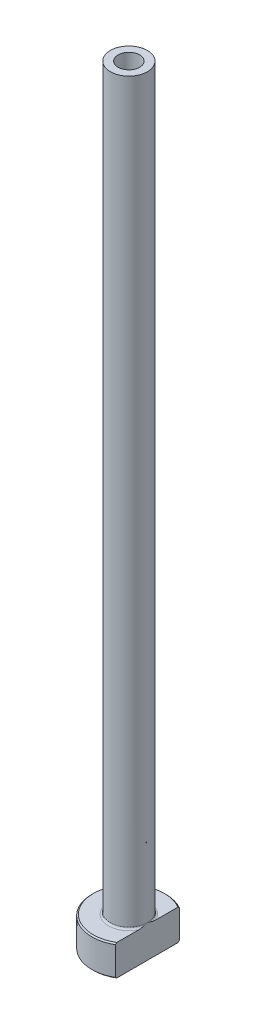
ISO-10303-21;
HEADER;
FILE_DESCRIPTION(('STEP AP214'),'2;1');
FILE_NAME('part.step','',(''),(''),'','','');
FILE_SCHEMA(('AUTOMOTIVE_DESIGN { 1 0 10303 214 1 1 1 1 }'));
ENDSEC;
DATA;
#1=APPLICATION_CONTEXT('core data for automotive mechanical design processes');
#2=APPLICATION_PROTOCOL_DEFINITION('international standard','automotive_design',2000,#1);
#3=PRODUCT_CONTEXT('',#1,'mechanical');
#4=PRODUCT('Part','Part','',(#3));
#5=PRODUCT_RELATED_PRODUCT_CATEGORY('part','',(#4));
#6=PRODUCT_DEFINITION_FORMATION('','',#4);
#7=PRODUCT_DEFINITION_CONTEXT('part definition',#1,'design');
#8=PRODUCT_DEFINITION('design','',#6,#7);
#9=PRODUCT_DEFINITION_SHAPE('','',#8);
#10=(LENGTH_UNIT() NAMED_UNIT(*) SI_UNIT(.MILLI.,.METRE.));
#11=(NAMED_UNIT(*) PLANE_ANGLE_UNIT() SI_UNIT($,.RADIAN.));
#12=(NAMED_UNIT(*) SI_UNIT($,.STERADIAN.) SOLID_ANGLE_UNIT());
#13=UNCERTAINTY_MEASURE_WITH_UNIT(LENGTH_MEASURE(1.E-05),#10,'distance_accuracy_value','');
#14=(GEOMETRIC_REPRESENTATION_CONTEXT(3) GLOBAL_UNCERTAINTY_ASSIGNED_CONTEXT((#13)) GLOBAL_UNIT_ASSIGNED_CONTEXT((#10,
#11,#12)) REPRESENTATION_CONTEXT('',''));
#15=CARTESIAN_POINT('',(0.,0.,0.));
#16=DIRECTION('',(0.,0.,1.));
#17=DIRECTION('',(1.,0.,0.));
#18=AXIS2_PLACEMENT_3D('',#15,#16,#17);
#19=CARTESIAN_POINT('',(0.,92.1876809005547,0.));
#20=DIRECTION('',(0.,1.,0.));
#21=DIRECTION('',(0.,0.,1.));
#22=AXIS2_PLACEMENT_3D('',#19,#20,#21);
#23=CYLINDRICAL_SURFACE('',#22,1.75);
#24=CARTESIAN_POINT('',(0.,125.,0.));
#25=DIRECTION('',(0.,1.,0.));
#26=DIRECTION('',(0.,0.,1.));
#27=AXIS2_PLACEMENT_3D('',#24,#25,#26);
#28=CIRCLE('',#27,1.75);
#29=CARTESIAN_POINT('',(0.,125.,1.75));
#30=VERTEX_POINT('',#29);
#31=EDGE_CURVE('E167',#30,#30,#28,.T.);
#32=ORIENTED_EDGE('',*,*,#31,.T.);
#33=EDGE_LOOP('',(#32));
#34=FACE_BOUND('',#33,.T.);
#35=CARTESIAN_POINT('',(0.,80.,0.));
#36=DIRECTION('',(0.,1.,0.));
#37=DIRECTION('',(0.,0.,1.));
#38=AXIS2_PLACEMENT_3D('',#35,#36,#37);
#39=CIRCLE('',#38,1.75);
#40=CARTESIAN_POINT('',(0.,80.,1.75));
#41=VERTEX_POINT('',#40);
#42=EDGE_CURVE('E170',#41,#41,#39,.T.);
#43=ORIENTED_EDGE('',*,*,#42,.F.);
#44=EDGE_LOOP('',(#43));
#45=FACE_BOUND('',#44,.T.);
#46=ADVANCED_FACE('F32',(#34,#45),#23,.F.);
#47=CARTESIAN_POINT('',(-1.75,125.,0.));
#48=DIRECTION('',(0.,1.,0.));
#49=DIRECTION('',(0.,0.,1.));
#50=AXIS2_PLACEMENT_3D('',#47,#48,#49);
#51=PLANE('',#50);
#52=CARTESIAN_POINT('',(0.,125.,0.));
#53=DIRECTION('',(0.,1.,0.));
#54=DIRECTION('',(0.,0.,1.));
#55=AXIS2_PLACEMENT_3D('',#52,#53,#54);
#56=CIRCLE('',#55,3.);
#57=CARTESIAN_POINT('',(0.,125.,3.));
#58=VERTEX_POINT('',#57);
#59=EDGE_CURVE('E174',#58,#58,#56,.T.);
#60=ORIENTED_EDGE('',*,*,#59,.T.);
#61=EDGE_LOOP('',(#60));
#62=FACE_BOUND('',#61,.T.);
#63=ORIENTED_EDGE('',*,*,#31,.F.);
#64=EDGE_LOOP('',(#63));
#65=FACE_BOUND('',#64,.T.);
#66=ADVANCED_FACE('F157',(#62,#65),#51,.T.);
#67=CARTESIAN_POINT('',(0.,92.1876809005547,0.));
#68=DIRECTION('',(0.,1.,0.));
#69=DIRECTION('',(0.,0.,1.));
#70=AXIS2_PLACEMENT_3D('',#67,#68,#69);
#71=CYLINDRICAL_SURFACE('',#70,3.);
#72=CARTESIAN_POINT('',(0.,5.3,0.));
#73=DIRECTION('',(0.,1.,0.));
#74=DIRECTION('',(0.,0.,1.));
#75=AXIS2_PLACEMENT_3D('',#72,#73,#74);
#76=CIRCLE('',#75,3.);
#77=CARTESIAN_POINT('',(3.,5.3,0.));
#78=VERTEX_POINT('',#77);
#79=EDGE_CURVE('E180',#78,#78,#76,.T.);
#80=ORIENTED_EDGE('',*,*,#79,.T.);
#81=EDGE_LOOP('',(#80));
#82=FACE_BOUND('',#81,.T.);
#83=ORIENTED_EDGE('',*,*,#59,.F.);
#84=EDGE_LOOP('',(#83));
#85=FACE_BOUND('',#84,.T.);
#86=ADVANCED_FACE('F162',(#82,#85),#71,.T.);
#87=CARTESIAN_POINT('',(-2.99999999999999,5.,0.));
#88=DIRECTION('',(0.,1.,0.));
#89=DIRECTION('',(0.,0.,1.));
#90=AXIS2_PLACEMENT_3D('',#87,#88,#89);
#91=PLANE('',#90);
#92=DIRECTION('',(0.,0.,1.));
#93=VECTOR('',#92,1.);
#94=CARTESIAN_POINT('',(3.,5.,0.));
#95=LINE('',#94,#93);
#96=CARTESIAN_POINT('',(3.,5.,-4.96386945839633));
#97=VERTEX_POINT('',#96);
#98=CARTESIAN_POINT('',(3.,5.,-1.37477270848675));
#99=VERTEX_POINT('',#98);
#100=EDGE_CURVE('E54',#97,#99,#95,.T.);
#101=ORIENTED_EDGE('',*,*,#100,.F.);
#102=CARTESIAN_POINT('',(0.,5.,0.));
#103=DIRECTION('',(0.,1.,0.));
#104=DIRECTION('',(0.,0.,1.));
#105=AXIS2_PLACEMENT_3D('',#102,#103,#104);
#106=CIRCLE('',#105,5.79999999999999);
#107=CARTESIAN_POINT('',(2.99999999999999,5.,4.96386945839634));
#108=VERTEX_POINT('',#107);
#109=EDGE_CURVE('E186',#97,#108,#106,.T.);
#110=ORIENTED_EDGE('',*,*,#109,.T.);
#111=CARTESIAN_POINT('',(3.,5.,1.37477270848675));
#112=VERTEX_POINT('',#111);
#113=EDGE_CURVE('E134',#112,#108,#95,.T.);
#114=ORIENTED_EDGE('',*,*,#113,.F.);
#115=CARTESIAN_POINT('',(0.,5.,0.));
#116=DIRECTION('',(0.,1.,0.));
#117=DIRECTION('',(0.,0.,1.));
#118=AXIS2_PLACEMENT_3D('',#115,#116,#117);
#119=CIRCLE('',#118,3.3);
#120=EDGE_CURVE('E183',#112,#99,#119,.F.);
#121=ORIENTED_EDGE('',*,*,#120,.T.);
#122=EDGE_LOOP('',(#101,#110,#114,#121));
#123=FACE_BOUND('',#122,.T.);
#124=ADVANCED_FACE('F197',(#123),#91,.T.);
#125=CARTESIAN_POINT('',(0.,92.1876809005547,0.));
#126=DIRECTION('',(0.,1.,0.));
#127=DIRECTION('',(0.,0.,1.));
#128=AXIS2_PLACEMENT_3D('',#125,#126,#127);
#129=CYLINDRICAL_SURFACE('',#128,5.99999999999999);
#130=DIRECTION('',(0.,-1.,0.));
#131=VECTOR('',#130,1.);
#132=CARTESIAN_POINT('',(2.99999999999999,125.,5.19615242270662));
#133=LINE('',#132,#131);
#134=CARTESIAN_POINT('',(2.99999999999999,4.8,5.19615242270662));
#135=VERTEX_POINT('',#134);
#136=CARTESIAN_POINT('',(2.99999999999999,0.20000000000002,5.19615242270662));
#137=VERTEX_POINT('',#136);
#138=EDGE_CURVE('E82',#135,#137,#133,.T.);
#139=ORIENTED_EDGE('',*,*,#138,.F.);
#140=CARTESIAN_POINT('',(0.,4.8,0.));
#141=DIRECTION('',(0.,1.,0.));
#142=DIRECTION('',(0.,0.,1.));
#143=AXIS2_PLACEMENT_3D('',#140,#141,#142);
#144=CIRCLE('',#143,5.99999999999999);
#145=CARTESIAN_POINT('',(3.,4.8,-5.19615242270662));
#146=VERTEX_POINT('',#145);
#147=EDGE_CURVE('E95',#135,#146,#144,.F.);
#148=ORIENTED_EDGE('',*,*,#147,.T.);
#149=DIRECTION('',(0.,-1.,0.));
#150=VECTOR('',#149,1.);
#151=CARTESIAN_POINT('',(3.,125.,-5.19615242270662));
#152=LINE('',#151,#150);
#153=CARTESIAN_POINT('',(3.,0.20000000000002,-5.19615242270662));
#154=VERTEX_POINT('',#153);
#155=EDGE_CURVE('E192',#146,#154,#152,.T.);
#156=ORIENTED_EDGE('',*,*,#155,.T.);
#157=CARTESIAN_POINT('',(0.,0.20000000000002,0.));
#158=DIRECTION('',(0.,-1.,0.));
#159=DIRECTION('',(0.,0.,-1.));
#160=AXIS2_PLACEMENT_3D('',#157,#158,#159);
#161=CIRCLE('',#160,5.99999999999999);
#162=EDGE_CURVE('E98',#154,#137,#161,.F.);
#163=ORIENTED_EDGE('',*,*,#162,.T.);
#164=EDGE_LOOP('',(#139,#148,#156,#163));
#165=FACE_BOUND('',#164,.T.);
#166=ADVANCED_FACE('F190',(#165),#129,.T.);
#167=CARTESIAN_POINT('',(-5.99999999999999,0.,0.));
#168=DIRECTION('',(0.,-1.,0.));
#169=DIRECTION('',(0.,0.,-1.));
#170=AXIS2_PLACEMENT_3D('',#167,#168,#169);
#171=PLANE('',#170);
#172=CARTESIAN_POINT('',(0.,0.,0.));
#173=DIRECTION('',(0.,-1.,0.));
#174=DIRECTION('',(0.,0.,-1.));
#175=AXIS2_PLACEMENT_3D('',#172,#173,#174);
#176=CIRCLE('',#175,2.49999999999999);
#177=CARTESIAN_POINT('',(0.,0.,-2.49999999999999));
#178=VERTEX_POINT('',#177);
#179=EDGE_CURVE('E40',#178,#178,#176,.F.);
#180=ORIENTED_EDGE('',*,*,#179,.T.);
#181=EDGE_LOOP('',(#180));
#182=FACE_BOUND('',#181,.T.);
#183=DIRECTION('',(0.,0.,-1.));
#184=VECTOR('',#183,1.);
#185=CARTESIAN_POINT('',(2.99999999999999,0.,5.19615242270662));
#186=LINE('',#185,#184);
#187=CARTESIAN_POINT('',(2.99999999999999,0.,4.96386945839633));
#188=VERTEX_POINT('',#187);
#189=CARTESIAN_POINT('',(2.99999999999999,0.,-4.96386945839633));
#190=VERTEX_POINT('',#189);
#191=EDGE_CURVE('E47',#188,#190,#186,.T.);
#192=ORIENTED_EDGE('',*,*,#191,.F.);
#193=CARTESIAN_POINT('',(0.,0.,0.));
#194=DIRECTION('',(0.,-1.,0.));
#195=DIRECTION('',(0.,0.,-1.));
#196=AXIS2_PLACEMENT_3D('',#193,#194,#195);
#197=CIRCLE('',#196,5.79999999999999);
#198=EDGE_CURVE('E92',#188,#190,#197,.T.);
#199=ORIENTED_EDGE('',*,*,#198,.T.);
#200=EDGE_LOOP('',(#192,#199));
#201=FACE_BOUND('',#200,.T.);
#202=ADVANCED_FACE('F91',(#182,#201),#171,.T.);
#203=CARTESIAN_POINT('',(0.,92.1876809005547,0.));
#204=DIRECTION('',(0.,1.,0.));
#205=DIRECTION('',(0.,0.,1.));
#206=AXIS2_PLACEMENT_3D('',#203,#204,#205);
#207=CYLINDRICAL_SURFACE('',#206,1.99999999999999);
#208=CARTESIAN_POINT('',(0.,0.499999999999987,0.));
#209=DIRECTION('',(0.,-1.,0.));
#210=DIRECTION('',(0.,0.,-1.));
#211=AXIS2_PLACEMENT_3D('',#208,#209,#210);
#212=CIRCLE('',#211,1.99999999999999);
#213=CARTESIAN_POINT('',(0.,0.499999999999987,-1.99999999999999));
#214=VERTEX_POINT('',#213);
#215=EDGE_CURVE('E11',#214,#214,#212,.T.);
#216=ORIENTED_EDGE('',*,*,#215,.T.);
#217=EDGE_LOOP('',(#216));
#218=FACE_BOUND('',#217,.T.);
#219=CARTESIAN_POINT('',(0.,68.,0.));
#220=DIRECTION('',(0.,1.,0.));
#221=DIRECTION('',(0.,0.,1.));
#222=AXIS2_PLACEMENT_3D('',#219,#220,#221);
#223=CIRCLE('',#222,2.);
#224=CARTESIAN_POINT('',(0.,68.,2.));
#225=VERTEX_POINT('',#224);
#226=EDGE_CURVE('E172',#225,#225,#223,.T.);
#227=ORIENTED_EDGE('',*,*,#226,.T.);
#228=EDGE_LOOP('',(#227));
#229=FACE_BOUND('',#228,.T.);
#230=ADVANCED_FACE('F215',(#218,#229),#207,.F.);
#231=CARTESIAN_POINT('',(0.,68.,0.));
#232=DIRECTION('',(0.,-1.,0.));
#233=DIRECTION('',(0.,0.,-1.));
#234=AXIS2_PLACEMENT_3D('',#231,#232,#233);
#235=CONICAL_SURFACE('',#234,2.,0.0208303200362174);
#236=ORIENTED_EDGE('',*,*,#42,.T.);
#237=EDGE_LOOP('',(#236));
#238=FACE_BOUND('',#237,.T.);
#239=ORIENTED_EDGE('',*,*,#226,.F.);
#240=EDGE_LOOP('',(#239));
#241=FACE_BOUND('',#240,.T.);
#242=ADVANCED_FACE('F111',(#238,#241),#235,.F.);
#243=CARTESIAN_POINT('',(0.,5.3,0.));
#244=DIRECTION('',(0.,1.,0.));
#245=DIRECTION('',(0.,0.,1.));
#246=AXIS2_PLACEMENT_3D('',#243,#244,#245);
#247=TOROIDAL_SURFACE('',#246,3.3,0.3);
#248=ORIENTED_EDGE('',*,*,#120,.F.);
#249=CARTESIAN_POINT('',(3.,5.3,0.));
#250=CARTESIAN_POINT('',(3.,5.30000062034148,-1.12611445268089E-10));
#251=CARTESIAN_POINT('',(3.,5.30000124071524,1.79706783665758E-07));
#252=CARTESIAN_POINT('',(3.,5.3000024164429,7.12597492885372E-07));
#253=CARTESIAN_POINT('',(3.,5.30000296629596,1.0747090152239E-06));
#254=CARTESIAN_POINT('',(3.,5.30000408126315,1.9394081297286E-06));
#255=CARTESIAN_POINT('',(3.,5.3000046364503,2.45488601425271E-06));
#256=CARTESIAN_POINT('',(3.,5.30000565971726,3.54465532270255E-06));
#257=CARTESIAN_POINT('',(3.,5.30000612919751,4.11770677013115E-06));
#258=CARTESIAN_POINT('',(3.,5.30000778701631,6.25396452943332E-06));
#259=CARTESIAN_POINT('',(3.,5.30000888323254,7.89070853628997E-06));
#260=CARTESIAN_POINT('',(3.,5.30001076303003,1.11998053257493E-05));
#261=CARTESIAN_POINT('',(3.,5.30001156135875,1.28642112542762E-05));
#262=CARTESIAN_POINT('',(3.,5.30001474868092,1.96537171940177E-05));
#263=CARTESIAN_POINT('',(3.,5.30001702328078,2.48380239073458E-05));
#264=CARTESIAN_POINT('',(3.,5.30002052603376,3.48178482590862E-05));
#265=CARTESIAN_POINT('',(3.,5.30002184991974,3.95800625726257E-05));
#266=CARTESIAN_POINT('',(3.,5.30003122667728,7.41814376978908E-05));
#267=CARTESIAN_POINT('',(3.,5.30003808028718,0.000104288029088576));
#268=CARTESIAN_POINT('',(2.99999999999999,5.300068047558,0.000222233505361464));
#269=CARTESIAN_POINT('',(2.99999999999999,5.30009687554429,0.000308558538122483));
#270=CARTESIAN_POINT('',(3.,5.30020809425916,0.000648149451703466));
#271=CARTESIAN_POINT('',(3.,5.30028657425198,0.000902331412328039));
#272=CARTESIAN_POINT('',(2.99999999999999,5.30059876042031,0.00190491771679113));
#273=CARTESIAN_POINT('',(2.99999999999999,5.30083723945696,0.00265218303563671));
#274=CARTESIAN_POINT('',(3.,5.30182192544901,0.00574694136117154));
#275=CARTESIAN_POINT('',(3.,5.30256224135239,0.00809584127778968));
#276=CARTESIAN_POINT('',(2.99999999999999,5.31160267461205,0.0367678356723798));
#277=CARTESIAN_POINT('',(2.99999999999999,5.31993817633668,0.0630827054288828));
#278=CARTESIAN_POINT('',(3.,5.33621504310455,0.114704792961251));
#279=CARTESIAN_POINT('',(3.,5.34415908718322,0.140011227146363));
#280=CARTESIAN_POINT('',(2.99999999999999,5.36094382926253,0.193774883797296));
#281=CARTESIAN_POINT('',(2.99999999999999,5.36977415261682,0.222235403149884));
#282=CARTESIAN_POINT('',(2.99999999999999,5.38736474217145,0.279512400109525));
#283=CARTESIAN_POINT('',(2.99999999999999,5.39612323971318,0.308329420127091));
#284=CARTESIAN_POINT('',(2.99999999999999,5.41726575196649,0.378880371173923));
#285=CARTESIAN_POINT('',(2.99999999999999,5.42952723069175,0.420651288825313));
#286=CARTESIAN_POINT('',(2.99999999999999,5.45309597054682,0.503357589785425));
#287=CARTESIAN_POINT('',(2.99999999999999,5.46441924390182,0.544288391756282));
#288=CARTESIAN_POINT('',(2.99999999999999,5.48778169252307,0.632156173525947));
#289=CARTESIAN_POINT('',(2.99999999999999,5.49969678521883,0.679126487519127));
#290=CARTESIAN_POINT('',(2.99999999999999,5.52221484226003,0.773740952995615));
#291=CARTESIAN_POINT('',(2.99999999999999,5.53280772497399,0.821387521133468));
#292=CARTESIAN_POINT('',(2.99999999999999,5.55291503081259,0.920589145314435));
#293=CARTESIAN_POINT('',(2.99999999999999,5.56229188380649,0.972172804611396));
#294=CARTESIAN_POINT('',(2.99999999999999,5.57838694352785,1.0757483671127));
#295=CARTESIAN_POINT('',(2.99999999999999,5.58510535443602,1.12774023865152));
#296=CARTESIAN_POINT('',(2.99999999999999,5.59681427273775,1.24924411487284));
#297=CARTESIAN_POINT('',(2.99999999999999,5.60051317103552,1.31890364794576));
#298=CARTESIAN_POINT('',(2.99999999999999,5.59966579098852,1.4227083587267));
#299=CARTESIAN_POINT('',(2.99999999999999,5.59835823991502,1.45688093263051));
#300=CARTESIAN_POINT('',(2.99999999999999,5.59322745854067,1.52502533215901));
#301=CARTESIAN_POINT('',(2.99999999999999,5.5894064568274,1.55899730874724));
#302=CARTESIAN_POINT('',(2.99999999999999,5.5797614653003,1.61947815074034));
#303=CARTESIAN_POINT('',(2.99999999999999,5.57451506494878,1.64607760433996));
#304=CARTESIAN_POINT('',(2.99999999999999,5.56161153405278,1.69883648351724));
#305=CARTESIAN_POINT('',(2.99999999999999,5.55394338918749,1.72499331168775));
#306=CARTESIAN_POINT('',(2.99999999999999,5.5355517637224,1.77650913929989));
#307=CARTESIAN_POINT('',(2.99999999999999,5.52480031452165,1.80185836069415));
#308=CARTESIAN_POINT('',(2.99999999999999,5.49948027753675,1.85054545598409));
#309=CARTESIAN_POINT('',(2.99999999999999,5.48493141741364,1.8738929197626));
#310=CARTESIAN_POINT('',(2.99999999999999,5.45992470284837,1.90552135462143));
#311=CARTESIAN_POINT('',(2.99999999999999,5.45133318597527,1.91527363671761));
#312=CARTESIAN_POINT('',(2.99999999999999,5.43294163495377,1.93360072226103));
#313=CARTESIAN_POINT('',(2.99999999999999,5.42314083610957,1.94217477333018));
#314=CARTESIAN_POINT('',(2.99999999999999,5.40215892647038,1.95778354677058));
#315=CARTESIAN_POINT('',(2.99999999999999,5.39096156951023,1.96479687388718));
#316=CARTESIAN_POINT('',(2.99999999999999,5.36742144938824,1.9765221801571));
#317=CARTESIAN_POINT('',(2.99999999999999,5.35508207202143,1.98124071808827));
#318=CARTESIAN_POINT('',(2.99999999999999,5.33320117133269,1.98690185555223));
#319=CARTESIAN_POINT('',(2.99999999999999,5.32383559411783,1.98852953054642));
#320=CARTESIAN_POINT('',(2.99999999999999,5.30496375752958,1.99016898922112));
#321=CARTESIAN_POINT('',(2.99999999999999,5.29545756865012,1.99018155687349));
#322=CARTESIAN_POINT('',(2.99999999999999,5.27659318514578,1.98858978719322));
#323=CARTESIAN_POINT('',(2.99999999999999,5.2672348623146,1.98698693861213));
#324=CARTESIAN_POINT('',(2.99999999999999,5.24889957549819,1.98229727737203));
#325=CARTESIAN_POINT('',(2.99999999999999,5.23992286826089,1.97920948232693));
#326=CARTESIAN_POINT('',(2.99999999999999,5.21981293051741,1.97059641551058));
#327=CARTESIAN_POINT('',(2.99999999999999,5.2088771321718,1.96461176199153));
#328=CARTESIAN_POINT('',(2.99999999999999,5.1881153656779,1.95095727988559));
#329=CARTESIAN_POINT('',(2.99999999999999,5.17829177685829,1.94328393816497));
#330=CARTESIAN_POINT('',(2.99999999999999,5.15512177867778,1.92254223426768));
#331=CARTESIAN_POINT('',(2.99999999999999,5.14247568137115,1.90869680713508));
#332=CARTESIAN_POINT('',(2.99999999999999,5.11944595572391,1.87927587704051));
#333=CARTESIAN_POINT('',(2.99999999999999,5.10906527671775,1.86369815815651));
#334=CARTESIAN_POINT('',(2.99999999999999,5.08309609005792,1.81927355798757));
#335=CARTESIAN_POINT('',(2.99999999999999,5.06948546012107,1.78928084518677));
#336=CARTESIAN_POINT('',(2.99999999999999,5.04658664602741,1.72751962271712));
#337=CARTESIAN_POINT('',(2.99999999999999,5.03733582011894,1.69573828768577));
#338=CARTESIAN_POINT('',(2.99999999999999,5.02214318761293,1.63079918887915));
#339=CARTESIAN_POINT('',(2.99999999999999,5.01626537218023,1.5976268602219));
#340=CARTESIAN_POINT('',(2.99999999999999,5.00734002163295,1.5308602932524));
#341=CARTESIAN_POINT('',(2.99999999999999,5.00429797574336,1.49726536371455));
#342=CARTESIAN_POINT('',(2.99999999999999,5.00059037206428,1.4310087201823));
#343=CARTESIAN_POINT('',(2.99999999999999,4.99985343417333,1.39835069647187));
#344=CARTESIAN_POINT('',(2.99999999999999,5.00019322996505,1.33318312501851));
#345=CARTESIAN_POINT('',(2.99999999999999,5.00126261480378,1.30067351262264));
#346=CARTESIAN_POINT('',(2.99999999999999,5.00569854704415,1.22190465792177));
#347=CARTESIAN_POINT('',(2.99999999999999,5.00984986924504,1.17569031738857));
#348=CARTESIAN_POINT('',(2.99999999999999,5.02060876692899,1.08357061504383));
#349=CARTESIAN_POINT('',(2.99999999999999,5.02721586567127,1.03766519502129));
#350=CARTESIAN_POINT('',(2.99999999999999,5.04258096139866,0.945130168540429));
#351=CARTESIAN_POINT('',(2.99999999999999,5.05138514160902,0.898508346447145));
#352=CARTESIAN_POINT('',(2.99999999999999,5.07066869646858,0.805496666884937));
#353=CARTESIAN_POINT('',(2.99999999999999,5.08115218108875,0.759107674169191));
#354=CARTESIAN_POINT('',(2.99999999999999,5.10738921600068,0.650207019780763));
#355=CARTESIAN_POINT('',(2.99999999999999,5.12369110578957,0.587828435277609));
#356=CARTESIAN_POINT('',(2.99999999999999,5.1577768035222,0.464212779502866));
#357=CARTESIAN_POINT('',(3.,5.17554263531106,0.402970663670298));
#358=CARTESIAN_POINT('',(2.99999999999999,5.21006724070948,0.287596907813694));
#359=CARTESIAN_POINT('',(2.99999999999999,5.22671796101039,0.233432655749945));
#360=CARTESIAN_POINT('',(3.,5.25241226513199,0.150940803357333));
#361=CARTESIAN_POINT('',(3.,5.26131063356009,0.122567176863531));
#362=CARTESIAN_POINT('',(2.99999999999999,5.27905176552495,0.0662804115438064));
#363=CARTESIAN_POINT('',(2.99999999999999,5.28789327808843,0.038366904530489));
#364=CARTESIAN_POINT('',(3.,5.29743877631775,0.00809257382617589));
#365=CARTESIAN_POINT('',(3.,5.29818012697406,0.00574041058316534));
#366=CARTESIAN_POINT('',(2.99999999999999,5.29916506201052,0.00264489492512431));
#367=CARTESIAN_POINT('',(2.99999999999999,5.29940274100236,0.00190013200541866));
#368=CARTESIAN_POINT('',(3.,5.29971394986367,0.000900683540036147));
#369=CARTESIAN_POINT('',(3.,5.29979223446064,0.000647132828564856));
#370=CARTESIAN_POINT('',(2.99999999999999,5.29990321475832,0.00030828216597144));
#371=CARTESIAN_POINT('',(2.99999999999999,5.29993200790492,0.000222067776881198));
#372=CARTESIAN_POINT('',(3.,5.29996194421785,0.00010425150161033));
#373=CARTESIAN_POINT('',(3.,5.29996879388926,7.41614214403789E-05));
#374=CARTESIAN_POINT('',(3.,5.2999781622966,3.95766689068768E-05));
#375=CARTESIAN_POINT('',(3.,5.29997948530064,3.48154647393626E-05));
#376=CARTESIAN_POINT('',(3.,5.29998298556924,2.48376263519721E-05));
#377=CARTESIAN_POINT('',(3.,5.29998525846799,1.96542440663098E-05));
#378=CARTESIAN_POINT('',(3.,5.29998844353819,1.28656647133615E-05));
#379=CARTESIAN_POINT('',(3.,5.29998924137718,1.12013341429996E-05));
#380=CARTESIAN_POINT('',(3.,5.2999911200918,7.89229957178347E-06));
#381=CARTESIAN_POINT('',(3.,5.29999221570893,6.25553476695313E-06));
#382=CARTESIAN_POINT('',(3.,5.2999938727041,4.11914331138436E-06));
#383=CARTESIAN_POINT('',(3.,5.29999434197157,3.54603058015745E-06));
#384=CARTESIAN_POINT('',(3.,5.29999536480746,2.45610037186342E-06));
#385=CARTESIAN_POINT('',(3.,5.29999591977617,1.94052202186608E-06));
#386=CARTESIAN_POINT('',(3.,5.29999703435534,1.07558305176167E-06));
#387=CARTESIAN_POINT('',(3.,5.2999975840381,7.13339298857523E-07));
#388=CARTESIAN_POINT('',(3.,5.29999875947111,1.80121878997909E-07));
#389=CARTESIAN_POINT('',(3.,5.29999937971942,1.12600889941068E-10));
#390=CARTESIAN_POINT('',(3.,5.3,0.));
#391=B_SPLINE_CURVE_WITH_KNOTS('',3,(#249,#250,#251,#252,#253,#254,#255,#256,#257,#258,#259,
#260,#261,#262,#263,#264,#265,#266,#267,#268,#269,#270,#271,#272,#273,#274,#275,#276,#277,#278,
#279,#280,#281,#282,#283,#284,#285,#286,#287,#288,#289,#290,#291,#292,#293,#294,#295,#296,#297,
#298,#299,#300,#301,#302,#303,#304,#305,#306,#307,#308,#309,#310,#311,#312,#313,#314,#315,#316,
#317,#318,#319,#320,#321,#322,#323,#324,#325,#326,#327,#328,#329,#330,#331,#332,#333,#334,#335,
#336,#337,#338,#339,#340,#341,#342,#343,#344,#345,#346,#347,#348,#349,#350,#351,#352,#353,#354,
#355,#356,#357,#358,#359,#360,#361,#362,#363,#364,#365,#366,#367,#368,#369,#370,#371,#372,#373,
#374,#375,#376,#377,#378,#379,#380,#381,#382,#383,#384,#385,#386,#387,#388,#389,#390),
.UNSPECIFIED.,.T.,.F.,(4,2,2,2,2,2,2,2,2,2,2,2,2,2,2,2,2,2,2,2,2,2,2,2,2,2,2,2,2,2,2,2,2,2,2,2,
2,2,2,2,2,2,2,2,2,2,2,2,2,2,2,2,2,2,2,2,2,2,2,2,2,2,2,2,2,2,2,2,2,2,4),(0.,1.86513924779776E-06,
3.83353357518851E-06,6.09513382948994E-06,8.31560727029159E-06,1.42000720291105E-05,
1.97335525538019E-05,3.66769888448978E-05,5.14858347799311E-05,0.000144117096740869,
0.000416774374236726,0.00121521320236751,0.00356794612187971,0.0109568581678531,
0.0937636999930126,0.173336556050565,0.262732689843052,0.353088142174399,0.483684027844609,
0.611082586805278,0.756439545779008,0.90284470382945,1.06007042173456,1.21728406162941,
1.42611662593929,1.52864191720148,1.63107642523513,1.71232857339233,1.7939557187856,
1.87634808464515,1.95832065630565,1.99722769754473,2.03615946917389,2.0755959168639,
2.11491897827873,2.14330913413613,2.1716855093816,2.20003575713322,2.22840478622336,
2.26559554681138,2.30286442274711,2.35880214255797,2.41481225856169,2.51307007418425,
2.61215518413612,2.71306273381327,2.81416520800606,2.91210427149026,3.00964583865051,
3.14875779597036,3.28784276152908,3.43014232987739,3.57279564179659,3.76617940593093,
3.95746724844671,4.12746077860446,4.21667041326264,4.30450746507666,4.31190664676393,
4.31425150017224,4.31504795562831,4.31532026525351,4.31541284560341,4.31542765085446,
4.31544458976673,4.31545012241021,4.31545600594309,4.31545822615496,4.3154604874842,
4.31546245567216,4.31546432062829),.UNSPECIFIED.);
#392=EDGE_CURVE('E126',#112,#78,#391,.T.);
#393=ORIENTED_EDGE('',*,*,#392,.T.);
#394=ORIENTED_EDGE('',*,*,#79,.F.);
#395=CARTESIAN_POINT('',(3.,5.3,0.));
#396=CARTESIAN_POINT('',(3.,5.29999937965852,1.1261208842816E-10));
#397=CARTESIAN_POINT('',(3.,5.29999875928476,-1.79706782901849E-07));
#398=CARTESIAN_POINT('',(3.,5.2999975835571,-7.12597491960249E-07));
#399=CARTESIAN_POINT('',(3.,5.29999703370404,-1.07470901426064E-06));
#400=CARTESIAN_POINT('',(3.,5.29999591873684,-1.93940812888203E-06));
#401=CARTESIAN_POINT('',(3.,5.29999536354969,-2.45488601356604E-06));
#402=CARTESIAN_POINT('',(3.,5.29999434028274,-3.54465532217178E-06));
#403=CARTESIAN_POINT('',(3.,5.29999387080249,-4.11770676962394E-06));
#404=CARTESIAN_POINT('',(3.,5.29999221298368,-6.25396452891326E-06));
#405=CARTESIAN_POINT('',(3.,5.29999111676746,-7.89070853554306E-06));
#406=CARTESIAN_POINT('',(3.,5.29998923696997,-1.1199805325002E-05));
#407=CARTESIAN_POINT('',(3.,5.29998843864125,-1.28642112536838E-05));
#408=CARTESIAN_POINT('',(3.,5.29998525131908,-1.96537171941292E-05));
#409=CARTESIAN_POINT('',(3.,5.29998297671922,-2.48380239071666E-05));
#410=CARTESIAN_POINT('',(3.,5.29997947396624,-3.48178482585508E-05));
#411=CARTESIAN_POINT('',(3.,5.29997815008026,-3.95800625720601E-05));
#412=CARTESIAN_POINT('',(3.,5.29996877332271,-7.41814376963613E-05));
#413=CARTESIAN_POINT('',(3.,5.29996191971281,-0.000104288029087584));
#414=CARTESIAN_POINT('',(2.99999999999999,5.29993195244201,-0.000222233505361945));
#415=CARTESIAN_POINT('',(2.99999999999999,5.29990312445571,-0.000308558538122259));
#416=CARTESIAN_POINT('',(3.,5.29979190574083,-0.000648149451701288));
#417=CARTESIAN_POINT('',(3.,5.29971342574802,-0.000902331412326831));
#418=CARTESIAN_POINT('',(2.99999999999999,5.2994012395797,-0.0019049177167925));
#419=CARTESIAN_POINT('',(2.99999999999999,5.29916276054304,-0.00265218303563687));
#420=CARTESIAN_POINT('',(3.,5.29817807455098,-0.00574694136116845));
#421=CARTESIAN_POINT('',(3.,5.29743775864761,-0.00809584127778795));
#422=CARTESIAN_POINT('',(2.99999999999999,5.28839732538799,-0.0367678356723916));
#423=CARTESIAN_POINT('',(2.99999999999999,5.28006182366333,-0.0630827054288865));
#424=CARTESIAN_POINT('',(3.,5.26378495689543,-0.114704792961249));
#425=CARTESIAN_POINT('',(3.,5.25584091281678,-0.140011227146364));
#426=CARTESIAN_POINT('',(2.99999999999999,5.23905617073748,-0.193774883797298));
#427=CARTESIAN_POINT('',(2.99999999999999,5.23022584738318,-0.222235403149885));
#428=CARTESIAN_POINT('',(2.99999999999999,5.21263525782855,-0.279512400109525));
#429=CARTESIAN_POINT('',(2.99999999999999,5.20387676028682,-0.308329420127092));
#430=CARTESIAN_POINT('',(2.99999999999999,5.18273424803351,-0.378880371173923));
#431=CARTESIAN_POINT('',(2.99999999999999,5.17047276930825,-0.420651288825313));
#432=CARTESIAN_POINT('',(2.99999999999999,5.14690402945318,-0.503357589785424));
#433=CARTESIAN_POINT('',(2.99999999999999,5.13558075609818,-0.544288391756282));
#434=CARTESIAN_POINT('',(2.99999999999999,5.11221830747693,-0.632156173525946));
#435=CARTESIAN_POINT('',(2.99999999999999,5.10030321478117,-0.679126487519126));
#436=CARTESIAN_POINT('',(2.99999999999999,5.07778515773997,-0.773740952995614));
#437=CARTESIAN_POINT('',(2.99999999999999,5.06719227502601,-0.821387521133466));
#438=CARTESIAN_POINT('',(2.99999999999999,5.0470849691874,-0.920589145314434));
#439=CARTESIAN_POINT('',(2.99999999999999,5.03770811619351,-0.972172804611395));
#440=CARTESIAN_POINT('',(2.99999999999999,5.02161305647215,-1.0757483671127));
#441=CARTESIAN_POINT('',(2.99999999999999,5.01489464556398,-1.12774023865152));
#442=CARTESIAN_POINT('',(2.99999999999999,5.00318572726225,-1.24924411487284));
#443=CARTESIAN_POINT('',(2.99999999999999,4.99948682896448,-1.31890364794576));
#444=CARTESIAN_POINT('',(2.99999999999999,5.00033420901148,-1.4227083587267));
#445=CARTESIAN_POINT('',(2.99999999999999,5.00164176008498,-1.45688093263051));
#446=CARTESIAN_POINT('',(2.99999999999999,5.00677254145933,-1.52502533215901));
#447=CARTESIAN_POINT('',(2.99999999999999,5.0105935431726,-1.55899730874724));
#448=CARTESIAN_POINT('',(2.99999999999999,5.0202385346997,-1.61947815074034));
#449=CARTESIAN_POINT('',(2.99999999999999,5.02548493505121,-1.64607760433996));
#450=CARTESIAN_POINT('',(2.99999999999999,5.03838846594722,-1.69883648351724));
#451=CARTESIAN_POINT('',(2.99999999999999,5.0460566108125,-1.72499331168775));
#452=CARTESIAN_POINT('',(2.99999999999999,5.0644482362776,-1.77650913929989));
#453=CARTESIAN_POINT('',(2.99999999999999,5.07519968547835,-1.80185836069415));
#454=CARTESIAN_POINT('',(2.99999999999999,5.10051972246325,-1.85054545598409));
#455=CARTESIAN_POINT('',(2.99999999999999,5.11506858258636,-1.8738929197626));
#456=CARTESIAN_POINT('',(2.99999999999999,5.14007529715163,-1.90552135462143));
#457=CARTESIAN_POINT('',(2.99999999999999,5.14866681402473,-1.91527363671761));
#458=CARTESIAN_POINT('',(2.99999999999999,5.16705836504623,-1.93360072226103));
#459=CARTESIAN_POINT('',(2.99999999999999,5.17685916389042,-1.94217477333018));
#460=CARTESIAN_POINT('',(2.99999999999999,5.19784107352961,-1.95778354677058));
#461=CARTESIAN_POINT('',(2.99999999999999,5.20903843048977,-1.96479687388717));
#462=CARTESIAN_POINT('',(2.99999999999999,5.23257855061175,-1.9765221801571));
#463=CARTESIAN_POINT('',(2.99999999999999,5.24491792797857,-1.98124071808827));
#464=CARTESIAN_POINT('',(2.99999999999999,5.26679882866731,-1.98690185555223));
#465=CARTESIAN_POINT('',(2.99999999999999,5.27616440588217,-1.98852953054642));
#466=CARTESIAN_POINT('',(2.99999999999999,5.29503624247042,-1.99016898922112));
#467=CARTESIAN_POINT('',(2.99999999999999,5.30454243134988,-1.99018155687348));
#468=CARTESIAN_POINT('',(2.99999999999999,5.32340681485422,-1.98858978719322));
#469=CARTESIAN_POINT('',(2.99999999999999,5.33276513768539,-1.98698693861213));
#470=CARTESIAN_POINT('',(2.99999999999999,5.35110042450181,-1.98229727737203));
#471=CARTESIAN_POINT('',(2.99999999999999,5.36007713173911,-1.97920948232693));
#472=CARTESIAN_POINT('',(2.99999999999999,5.38018706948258,-1.97059641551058));
#473=CARTESIAN_POINT('',(2.99999999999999,5.39112286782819,-1.96461176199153));
#474=CARTESIAN_POINT('',(2.99999999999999,5.4118846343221,-1.95095727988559));
#475=CARTESIAN_POINT('',(2.99999999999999,5.42170822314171,-1.94328393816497));
#476=CARTESIAN_POINT('',(2.99999999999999,5.44487822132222,-1.92254223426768));
#477=CARTESIAN_POINT('',(2.99999999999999,5.45752431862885,-1.90869680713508));
#478=CARTESIAN_POINT('',(2.99999999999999,5.48055404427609,-1.87927587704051));
#479=CARTESIAN_POINT('',(2.99999999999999,5.49093472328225,-1.86369815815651));
#480=CARTESIAN_POINT('',(2.99999999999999,5.51690390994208,-1.81927355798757));
#481=CARTESIAN_POINT('',(2.99999999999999,5.53051453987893,-1.78928084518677));
#482=CARTESIAN_POINT('',(2.99999999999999,5.55341335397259,-1.72751962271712));
#483=CARTESIAN_POINT('',(2.99999999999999,5.56266417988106,-1.69573828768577));
#484=CARTESIAN_POINT('',(2.99999999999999,5.57785681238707,-1.63079918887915));
#485=CARTESIAN_POINT('',(2.99999999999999,5.58373462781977,-1.5976268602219));
#486=CARTESIAN_POINT('',(2.99999999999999,5.59265997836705,-1.53086029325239));
#487=CARTESIAN_POINT('',(2.99999999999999,5.59570202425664,-1.49726536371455));
#488=CARTESIAN_POINT('',(2.99999999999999,5.59940962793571,-1.4310087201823));
#489=CARTESIAN_POINT('',(2.99999999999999,5.60014656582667,-1.39835069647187));
#490=CARTESIAN_POINT('',(2.99999999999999,5.59980677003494,-1.33318312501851));
#491=CARTESIAN_POINT('',(2.99999999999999,5.59873738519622,-1.30067351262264));
#492=CARTESIAN_POINT('',(2.99999999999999,5.59430145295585,-1.22190465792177));
#493=CARTESIAN_POINT('',(2.99999999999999,5.59015013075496,-1.17569031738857));
#494=CARTESIAN_POINT('',(2.99999999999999,5.57939123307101,-1.08357061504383));
#495=CARTESIAN_POINT('',(2.99999999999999,5.57278413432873,-1.03766519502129));
#496=CARTESIAN_POINT('',(2.99999999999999,5.55741903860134,-0.945130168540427));
#497=CARTESIAN_POINT('',(2.99999999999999,5.54861485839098,-0.898508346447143));
#498=CARTESIAN_POINT('',(2.99999999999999,5.52933130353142,-0.805496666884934));
#499=CARTESIAN_POINT('',(2.99999999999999,5.51884781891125,-0.759107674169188));
#500=CARTESIAN_POINT('',(2.99999999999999,5.49261078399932,-0.65020701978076));
#501=CARTESIAN_POINT('',(2.99999999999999,5.47630889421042,-0.587828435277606));
#502=CARTESIAN_POINT('',(2.99999999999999,5.4422231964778,-0.464212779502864));
#503=CARTESIAN_POINT('',(3.,5.42445736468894,-0.402970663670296));
#504=CARTESIAN_POINT('',(2.99999999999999,5.38993275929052,-0.287596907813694));
#505=CARTESIAN_POINT('',(2.99999999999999,5.37328203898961,-0.233432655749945));
#506=CARTESIAN_POINT('',(3.,5.34758773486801,-0.150940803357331));
#507=CARTESIAN_POINT('',(3.,5.33868936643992,-0.122567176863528));
#508=CARTESIAN_POINT('',(2.99999999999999,5.32094823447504,-0.0662804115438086));
#509=CARTESIAN_POINT('',(2.99999999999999,5.31210672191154,-0.0383669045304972));
#510=CARTESIAN_POINT('',(3.,5.30256122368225,-0.00809257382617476));
#511=CARTESIAN_POINT('',(3.,5.30181987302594,-0.00574041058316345));
#512=CARTESIAN_POINT('',(2.99999999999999,5.30083493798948,-0.0026448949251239));
#513=CARTESIAN_POINT('',(2.99999999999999,5.30059725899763,-0.0019001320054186));
#514=CARTESIAN_POINT('',(3.,5.30028605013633,-0.000900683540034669));
#515=CARTESIAN_POINT('',(3.,5.30020776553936,-0.000647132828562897));
#516=CARTESIAN_POINT('',(2.99999999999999,5.30009678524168,-0.000308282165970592));
#517=CARTESIAN_POINT('',(2.99999999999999,5.30006799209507,-0.000222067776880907));
#518=CARTESIAN_POINT('',(3.,5.30003805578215,-0.000104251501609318));
#519=CARTESIAN_POINT('',(3.,5.30003120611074,-7.41614214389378E-05));
#520=CARTESIAN_POINT('',(3.,5.30002183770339,-3.95766689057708E-05));
#521=CARTESIAN_POINT('',(3.,5.30002051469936,-3.48154647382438E-05));
#522=CARTESIAN_POINT('',(3.,5.30001701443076,-2.4837626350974E-05));
#523=CARTESIAN_POINT('',(3.,5.30001474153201,-1.96542440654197E-05));
#524=CARTESIAN_POINT('',(3.,5.30001155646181,-1.28656647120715E-05));
#525=CARTESIAN_POINT('',(3.,5.30001075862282,-1.12013341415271E-05));
#526=CARTESIAN_POINT('',(3.,5.3000088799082,-7.8922995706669E-06));
#527=CARTESIAN_POINT('',(3.,5.30000778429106,-6.25553476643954E-06));
#528=CARTESIAN_POINT('',(3.,5.30000612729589,-4.1191433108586E-06));
#529=CARTESIAN_POINT('',(3.,5.30000565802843,-3.54603057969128E-06));
#530=CARTESIAN_POINT('',(3.,5.30000463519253,-2.45610037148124E-06));
#531=CARTESIAN_POINT('',(3.,5.30000408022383,-1.94052202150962E-06));
#532=CARTESIAN_POINT('',(3.,5.30000296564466,-1.07558305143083E-06));
#533=CARTESIAN_POINT('',(3.,5.3000024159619,-7.13339298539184E-07));
#534=CARTESIAN_POINT('',(3.,5.30000124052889,-1.80121878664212E-07));
#535=CARTESIAN_POINT('',(3.,5.30000062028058,-1.12600531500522E-10));
#536=CARTESIAN_POINT('',(3.,5.3,0.));
#537=B_SPLINE_CURVE_WITH_KNOTS('',3,(#395,#396,#397,#398,#399,#400,#401,#402,#403,#404,#405,
#406,#407,#408,#409,#410,#411,#412,#413,#414,#415,#416,#417,#418,#419,#420,#421,#422,#423,#424,
#425,#426,#427,#428,#429,#430,#431,#432,#433,#434,#435,#436,#437,#438,#439,#440,#441,#442,#443,
#444,#445,#446,#447,#448,#449,#450,#451,#452,#453,#454,#455,#456,#457,#458,#459,#460,#461,#462,
#463,#464,#465,#466,#467,#468,#469,#470,#471,#472,#473,#474,#475,#476,#477,#478,#479,#480,#481,
#482,#483,#484,#485,#486,#487,#488,#489,#490,#491,#492,#493,#494,#495,#496,#497,#498,#499,#500,
#501,#502,#503,#504,#505,#506,#507,#508,#509,#510,#511,#512,#513,#514,#515,#516,#517,#518,#519,
#520,#521,#522,#523,#524,#525,#526,#527,#528,#529,#530,#531,#532,#533,#534,#535,#536),
.UNSPECIFIED.,.T.,.F.,(4,2,2,2,2,2,2,2,2,2,2,2,2,2,2,2,2,2,2,2,2,2,2,2,2,2,2,2,2,2,2,2,2,2,2,2,
2,2,2,2,2,2,2,2,2,2,2,2,2,2,2,2,2,2,2,2,2,2,2,2,2,2,2,2,2,2,2,2,2,2,4),(0.,1.86513924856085E-06,
3.83353357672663E-06,6.09513383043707E-06,8.3156072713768E-06,1.42000720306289E-05,
1.97335525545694E-05,3.66769888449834E-05,5.14858347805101E-05,0.000144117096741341,
0.000416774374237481,0.00121521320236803,0.00356794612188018,0.0109568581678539,
0.0937636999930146,0.173336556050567,0.262732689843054,0.3530881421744,0.483684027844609,
0.611082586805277,0.756439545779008,0.90284470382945,1.06007042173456,1.21728406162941,
1.42611662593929,1.52864191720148,1.63107642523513,1.71232857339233,1.7939557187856,
1.87634808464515,1.95832065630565,1.99722769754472,2.03615946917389,2.07559591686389,
2.11491897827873,2.14330913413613,2.1716855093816,2.20003575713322,2.22840478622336,
2.26559554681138,2.30286442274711,2.35880214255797,2.41481225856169,2.51307007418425,
2.61215518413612,2.71306273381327,2.81416520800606,2.91210427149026,3.00964583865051,
3.14875779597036,3.28784276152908,3.4301423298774,3.57279564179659,3.76617940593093,
3.95746724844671,4.12746077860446,4.21667041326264,4.30450746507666,4.31190664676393,
4.31425150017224,4.31504795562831,4.31532026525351,4.31541284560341,4.31542765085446,
4.31544458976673,4.31545012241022,4.31545600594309,4.31545822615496,4.3154604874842,
4.31546245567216,4.31546432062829),.UNSPECIFIED.);
#538=EDGE_CURVE('E135',#78,#99,#537,.T.);
#539=ORIENTED_EDGE('',*,*,#538,.T.);
#540=EDGE_LOOP('',(#248,#393,#394,#539));
#541=FACE_BOUND('',#540,.T.);
#542=ADVANCED_FACE('F141',(#541),#247,.F.);
#543=CARTESIAN_POINT('',(0.,5.,0.));
#544=DIRECTION('',(0.,-1.,0.));
#545=DIRECTION('',(0.,0.,-1.));
#546=AXIS2_PLACEMENT_3D('',#543,#544,#545);
#547=CONICAL_SURFACE('',#546,5.79999999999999,0.785398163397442);
#548=CARTESIAN_POINT('',(3.,-1.01993959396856,-11.432889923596));
#549=CARTESIAN_POINT('',(3.,-0.769424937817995,-11.1738796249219));
#550=CARTESIAN_POINT('',(3.,-0.519179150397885,-10.9146084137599));
#551=CARTESIAN_POINT('',(3.,-0.0193842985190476,-10.395389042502));
#552=CARTESIAN_POINT('',(3.,0.230164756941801,-10.1354408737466));
#553=CARTESIAN_POINT('',(3.,0.728528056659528,-9.61458602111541));
#554=CARTESIAN_POINT('',(3.,0.97734186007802,-9.3536789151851));
#555=CARTESIAN_POINT('',(3.,1.47386965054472,-8.8308227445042));
#556=CARTESIAN_POINT('',(3.,1.72158364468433,-8.56887368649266));
#557=CARTESIAN_POINT('',(3.,2.21069282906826,-8.04884148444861));
#558=CARTESIAN_POINT('',(3.,2.45211594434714,-7.79078462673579));
#559=CARTESIAN_POINT('',(3.,2.93315589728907,-7.2729934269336));
#560=CARTESIAN_POINT('',(3.,3.17277274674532,-7.01325909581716));
#561=CARTESIAN_POINT('',(3.,3.64950020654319,-6.49159990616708));
#562=CARTESIAN_POINT('',(3.,3.88661134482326,-6.2296755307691));
#563=CARTESIAN_POINT('',(3.,4.35738571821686,-5.70275148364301));
#564=CARTESIAN_POINT('',(3.,4.59104909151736,-5.43775193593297));
#565=CARTESIAN_POINT('',(3.,4.96416348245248,-5.00636825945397));
#566=CARTESIAN_POINT('',(3.,5.10520133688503,-4.84135845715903));
#567=CARTESIAN_POINT('',(3.,5.38476673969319,-4.50919282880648));
#568=CARTESIAN_POINT('',(3.,5.52329404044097,-4.34203679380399));
#569=CARTESIAN_POINT('',(3.,5.79842961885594,-4.00319933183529));
#570=CARTESIAN_POINT('',(3.,5.93500216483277,-3.83148875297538));
#571=CARTESIAN_POINT('',(3.,6.20336281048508,-3.48442112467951));
#572=CARTESIAN_POINT('',(3.,6.33515205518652,-3.30906496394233));
#573=CARTESIAN_POINT('',(3.,6.59393382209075,-2.95070802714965));
#574=CARTESIAN_POINT('',(2.99999999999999,6.72082315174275,-2.76763161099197));
#575=CARTESIAN_POINT('',(2.99999999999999,6.90336321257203,-2.48771743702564));
#576=CARTESIAN_POINT('',(2.99999999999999,6.96295431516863,-2.39345390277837));
#577=CARTESIAN_POINT('',(2.99999999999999,7.07882720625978,-2.20292146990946));
#578=CARTESIAN_POINT('',(2.99999999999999,7.13510937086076,-2.10665280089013));
#579=CARTESIAN_POINT('',(2.99999999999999,7.24288059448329,-1.91297779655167));
#580=CARTESIAN_POINT('',(2.99999999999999,7.29441986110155,-1.81559978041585));
#581=CARTESIAN_POINT('',(2.99999999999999,7.39241237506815,-1.61833215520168));
#582=CARTESIAN_POINT('',(2.99999999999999,7.43886469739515,-1.51844209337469));
#583=CARTESIAN_POINT('',(2.99999999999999,7.56840030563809,-1.21511948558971));
#584=CARTESIAN_POINT('',(2.99999999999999,7.64209011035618,-1.00730397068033));
#585=CARTESIAN_POINT('',(2.99999999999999,7.72186700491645,-0.695731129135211));
#586=CARTESIAN_POINT('',(2.99999999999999,7.7430290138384,-0.59579170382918));
#587=CARTESIAN_POINT('',(2.99999999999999,7.77582528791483,-0.394325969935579));
#588=CARTESIAN_POINT('',(2.99999999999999,7.78746040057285,-0.292799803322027));
#589=CARTESIAN_POINT('',(2.99999999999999,7.80037895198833,-0.0893987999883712));
#590=CARTESIAN_POINT('',(2.99999999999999,7.80169449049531,0.0124739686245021));
#591=CARTESIAN_POINT('',(2.99999999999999,7.79396363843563,0.215826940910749));
#592=CARTESIAN_POINT('',(2.99999999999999,7.78491639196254,0.317307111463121));
#593=CARTESIAN_POINT('',(2.99999999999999,7.75721241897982,0.518039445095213));
#594=CARTESIAN_POINT('',(2.99999999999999,7.73863812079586,0.617303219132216));
#595=CARTESIAN_POINT('',(2.99999999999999,7.69303955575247,0.813850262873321));
#596=CARTESIAN_POINT('',(2.99999999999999,7.66601427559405,0.911133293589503));
#597=CARTESIAN_POINT('',(2.99999999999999,7.60464499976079,1.10394843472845));
#598=CARTESIAN_POINT('',(2.99999999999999,7.57025976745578,1.19946724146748));
#599=CARTESIAN_POINT('',(2.99999999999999,7.4955576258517,1.38810736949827));
#600=CARTESIAN_POINT('',(2.99999999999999,7.45524192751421,1.48122917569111));
#601=CARTESIAN_POINT('',(2.99999999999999,7.36961028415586,1.66561491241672));
#602=CARTESIAN_POINT('',(2.99999999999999,7.32427350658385,1.75686908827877));
#603=CARTESIAN_POINT('',(2.99999999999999,7.22966073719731,1.93732130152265));
#604=CARTESIAN_POINT('',(2.99999999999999,7.18038388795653,2.02651888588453));
#605=CARTESIAN_POINT('',(2.99999999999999,7.02771106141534,2.29153460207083));
#606=CARTESIAN_POINT('',(2.99999999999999,6.91955486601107,2.46460625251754));
#607=CARTESIAN_POINT('',(2.99999999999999,6.69440299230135,2.8057702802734));
#608=CARTESIAN_POINT('',(2.99999999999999,6.57737415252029,2.97384034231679));
#609=CARTESIAN_POINT('',(2.99999999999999,6.33748949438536,3.3056177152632));
#610=CARTESIAN_POINT('',(2.99999999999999,6.21463662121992,3.46932716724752));
#611=CARTESIAN_POINT('',(2.99999999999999,5.96308085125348,3.79561670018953));
#612=CARTESIAN_POINT('',(2.99999999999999,5.83432224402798,3.95815356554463));
#613=CARTESIAN_POINT('',(2.99999999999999,5.57361365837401,4.28066737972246));
#614=CARTESIAN_POINT('',(2.99999999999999,5.44166333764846,4.44064405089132));
#615=CARTESIAN_POINT('',(2.99999999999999,5.17568445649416,4.75819552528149));
#616=CARTESIAN_POINT('',(2.99999999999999,5.04166171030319,4.915775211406));
#617=CARTESIAN_POINT('',(2.99999999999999,4.77176230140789,5.22934053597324));
#618=CARTESIAN_POINT('',(2.99999999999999,4.63588560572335,5.38532614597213));
#619=CARTESIAN_POINT('',(2.99999999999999,4.2725622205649,5.79849838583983));
#620=CARTESIAN_POINT('',(2.99999999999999,4.04384014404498,6.05456265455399));
#621=CARTESIAN_POINT('',(2.99999999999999,3.58360020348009,6.5641703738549));
#622=CARTESIAN_POINT('',(2.99999999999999,3.35208226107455,6.81771375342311));
#623=CARTESIAN_POINT('',(2.99999999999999,2.88678846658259,7.32315936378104));
#624=CARTESIAN_POINT('',(2.99999999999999,2.65301069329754,7.57505982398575));
#625=CARTESIAN_POINT('',(2.99999999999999,2.18392232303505,8.07742926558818));
#626=CARTESIAN_POINT('',(2.99999999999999,1.94861172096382,8.32789824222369));
#627=CARTESIAN_POINT('',(2.99999999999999,1.48651581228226,8.81743943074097));
#628=CARTESIAN_POINT('',(2.99999999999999,1.2597780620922,9.05655656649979));
#629=CARTESIAN_POINT('',(2.99999999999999,0.805439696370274,9.53397105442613));
#630=CARTESIAN_POINT('',(2.99999999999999,0.577839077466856,9.77226840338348));
#631=CARTESIAN_POINT('',(2.99999999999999,0.122198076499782,10.2479325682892));
#632=CARTESIAN_POINT('',(2.99999999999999,-0.105841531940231,10.4853001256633));
#633=CARTESIAN_POINT('',(2.99999999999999,-0.562491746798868,10.9594816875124));
#634=CARTESIAN_POINT('',(2.99999999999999,-0.791102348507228,11.1962956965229));
#635=CARTESIAN_POINT('',(2.99999999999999,-1.01993959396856,11.432889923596));
#636=B_SPLINE_CURVE_WITH_KNOTS('',3,(#548,#549,#550,#551,#552,#553,#554,#555,#556,#557,#558,
#559,#560,#561,#562,#563,#564,#565,#566,#567,#568,#569,#570,#571,#572,#573,#574,#575,#576,#577,
#578,#579,#580,#581,#582,#583,#584,#585,#586,#587,#588,#589,#590,#591,#592,#593,#594,#595,#596,
#597,#598,#599,#600,#601,#602,#603,#604,#605,#606,#607,#608,#609,#610,#611,#612,#613,#614,#615,
#616,#617,#618,#619,#620,#621,#622,#623,#624,#625,#626,#627,#628,#629,#630,#631,#632,#633,#634,
#635),.UNSPECIFIED.,.F.,.F.,(4,2,2,2,2,2,2,2,2,2,2,2,2,2,2,2,2,2,2,2,2,2,2,2,2,2,2,2,2,2,2,2,2,
2,2,2,2,2,2,2,2,2,2,4),(0.,1.08101662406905,2.16204714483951,3.24363027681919,4.32520642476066,
5.38534462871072,6.44547590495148,7.50537917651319,8.56523985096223,9.21643479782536,
9.86769362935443,10.5258323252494,11.1838124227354,11.8517813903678,12.1862877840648,
12.5207560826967,12.8511332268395,13.1815703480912,13.8399161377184,14.1460077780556,
14.4520721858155,14.7571841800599,15.0623213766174,15.3648619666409,15.6674388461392,
15.9717575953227,16.2760142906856,16.5815843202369,16.8872210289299,17.4990577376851,
18.1133060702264,18.7272470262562,19.3492675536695,19.9713550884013,20.5919343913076,
21.2125247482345,22.2425132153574,23.2725306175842,24.3035181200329,25.3345090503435,
26.3230827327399,27.3116602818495,28.299135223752,29.2866020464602),.UNSPECIFIED.);
#637=EDGE_CURVE('E133',#146,#97,#636,.T.);
#638=ORIENTED_EDGE('',*,*,#637,.F.);
#639=ORIENTED_EDGE('',*,*,#147,.F.);
#640=EDGE_CURVE('E118',#108,#135,#636,.T.);
#641=ORIENTED_EDGE('',*,*,#640,.F.);
#642=ORIENTED_EDGE('',*,*,#109,.F.);
#643=EDGE_LOOP('',(#638,#639,#641,#642));
#644=FACE_BOUND('',#643,.T.);
#645=ADVANCED_FACE('F145',(#644),#547,.T.);
#646=CARTESIAN_POINT('',(0.,0.20000000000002,0.));
#647=DIRECTION('',(0.,1.,0.));
#648=DIRECTION('',(0.,0.,1.));
#649=AXIS2_PLACEMENT_3D('',#646,#647,#648);
#650=CONICAL_SURFACE('',#649,5.99999999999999,0.785398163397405);
#651=CARTESIAN_POINT('',(2.99999999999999,6.01993959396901,11.432889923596));
#652=CARTESIAN_POINT('',(2.99999999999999,5.76942493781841,11.1738796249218));
#653=CARTESIAN_POINT('',(2.99999999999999,5.51917915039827,10.9146084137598));
#654=CARTESIAN_POINT('',(2.99999999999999,5.01938429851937,10.3953890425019));
#655=CARTESIAN_POINT('',(2.99999999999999,4.76983524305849,10.1354408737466));
#656=CARTESIAN_POINT('',(2.99999999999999,4.2714719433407,9.61458602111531));
#657=CARTESIAN_POINT('',(2.99999999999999,4.02265813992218,9.353678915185));
#658=CARTESIAN_POINT('',(2.99999999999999,3.52613034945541,8.83082274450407));
#659=CARTESIAN_POINT('',(2.99999999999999,3.27841635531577,8.56887368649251));
#660=CARTESIAN_POINT('',(2.99999999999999,2.78930717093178,8.04884148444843));
#661=CARTESIAN_POINT('',(2.99999999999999,2.54788405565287,7.7907846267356));
#662=CARTESIAN_POINT('',(2.99999999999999,2.06684410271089,7.27299342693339));
#663=CARTESIAN_POINT('',(2.99999999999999,1.82722725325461,7.01325909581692));
#664=CARTESIAN_POINT('',(2.99999999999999,1.35049979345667,6.49159990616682));
#665=CARTESIAN_POINT('',(2.99999999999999,1.11338865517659,6.22967553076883));
#666=CARTESIAN_POINT('',(2.99999999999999,0.642614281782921,5.70275148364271));
#667=CARTESIAN_POINT('',(2.99999999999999,0.408950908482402,5.43775193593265));
#668=CARTESIAN_POINT('',(2.99999999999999,0.0358365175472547,5.00636825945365));
#669=CARTESIAN_POINT('',(2.99999999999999,-0.105201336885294,4.84135845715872));
#670=CARTESIAN_POINT('',(2.99999999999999,-0.384766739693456,4.50919282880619));
#671=CARTESIAN_POINT('',(2.99999999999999,-0.523294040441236,4.34203679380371));
#672=CARTESIAN_POINT('',(2.99999999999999,-0.798429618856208,4.00319933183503));
#673=CARTESIAN_POINT('',(2.99999999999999,-0.935002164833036,3.83148875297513));
#674=CARTESIAN_POINT('',(2.99999999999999,-1.20336281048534,3.48442112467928));
#675=CARTESIAN_POINT('',(2.99999999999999,-1.33515205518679,3.3090649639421));
#676=CARTESIAN_POINT('',(2.99999999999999,-1.59393382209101,2.95070802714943));
#677=CARTESIAN_POINT('',(2.99999999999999,-1.72082315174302,2.76763161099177));
#678=CARTESIAN_POINT('',(2.99999999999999,-1.90336321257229,2.48771743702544));
#679=CARTESIAN_POINT('',(2.99999999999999,-1.96295431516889,2.39345390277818));
#680=CARTESIAN_POINT('',(2.99999999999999,-2.07882720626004,2.20292146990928));
#681=CARTESIAN_POINT('',(2.99999999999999,-2.13510937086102,2.10665280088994));
#682=CARTESIAN_POINT('',(2.99999999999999,-2.24288059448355,1.9129777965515));
#683=CARTESIAN_POINT('',(2.99999999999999,-2.29441986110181,1.81559978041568));
#684=CARTESIAN_POINT('',(2.99999999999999,-2.3924123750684,1.61833215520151));
#685=CARTESIAN_POINT('',(2.99999999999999,-2.4388646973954,1.51844209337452));
#686=CARTESIAN_POINT('',(2.99999999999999,-2.56840030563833,1.21511948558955));
#687=CARTESIAN_POINT('',(2.99999999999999,-2.64209011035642,1.00730397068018));
#688=CARTESIAN_POINT('',(2.99999999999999,-2.72186700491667,0.695731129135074));
#689=CARTESIAN_POINT('',(2.99999999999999,-2.74302901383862,0.595791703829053));
#690=CARTESIAN_POINT('',(2.99999999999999,-2.77582528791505,0.394325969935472));
#691=CARTESIAN_POINT('',(2.99999999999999,-2.78746040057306,0.292799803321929));
#692=CARTESIAN_POINT('',(2.99999999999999,-2.80037895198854,0.0893987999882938));
#693=CARTESIAN_POINT('',(2.99999999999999,-2.80169449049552,-0.0124739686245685));
#694=CARTESIAN_POINT('',(2.99999999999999,-2.79396363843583,-0.215826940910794));
#695=CARTESIAN_POINT('',(2.99999999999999,-2.78491639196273,-0.317307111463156));
#696=CARTESIAN_POINT('',(2.99999999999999,-2.75721241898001,-0.518039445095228));
#697=CARTESIAN_POINT('',(2.99999999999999,-2.73863812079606,-0.617303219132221));
#698=CARTESIAN_POINT('',(2.99999999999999,-2.69303955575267,-0.813850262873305));
#699=CARTESIAN_POINT('',(2.99999999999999,-2.66601427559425,-0.911133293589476));
#700=CARTESIAN_POINT('',(2.99999999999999,-2.604644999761,-1.1039484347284));
#701=CARTESIAN_POINT('',(2.99999999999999,-2.57025976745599,-1.19946724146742));
#702=CARTESIAN_POINT('',(2.99999999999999,-2.49555762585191,-1.38810736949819));
#703=CARTESIAN_POINT('',(2.99999999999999,-2.45524192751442,-1.48122917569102));
#704=CARTESIAN_POINT('',(2.99999999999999,-2.36961028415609,-1.66561491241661));
#705=CARTESIAN_POINT('',(2.99999999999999,-2.32427350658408,-1.75686908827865));
#706=CARTESIAN_POINT('',(2.99999999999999,-2.22966073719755,-1.93732130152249));
#707=CARTESIAN_POINT('',(2.99999999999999,-2.18038388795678,-2.02651888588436));
#708=CARTESIAN_POINT('',(2.99999999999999,-2.02771106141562,-2.29153460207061));
#709=CARTESIAN_POINT('',(3.,-1.91955486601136,-2.46460625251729));
#710=CARTESIAN_POINT('',(3.,-1.69440299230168,-2.8057702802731));
#711=CARTESIAN_POINT('',(3.,-1.57737415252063,-2.97384034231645));
#712=CARTESIAN_POINT('',(3.,-1.33748949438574,-3.30561771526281));
#713=CARTESIAN_POINT('',(3.,-1.21463662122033,-3.46932716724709));
#714=CARTESIAN_POINT('',(3.,-0.963080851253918,-3.79561670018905));
#715=CARTESIAN_POINT('',(3.,-0.834322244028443,-3.95815356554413));
#716=CARTESIAN_POINT('',(3.,-0.573613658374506,-4.2806673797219));
#717=CARTESIAN_POINT('',(3.,-0.441663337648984,-4.44064405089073));
#718=CARTESIAN_POINT('',(3.,-0.175684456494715,-4.75819552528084));
#719=CARTESIAN_POINT('',(3.,-0.0416617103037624,-4.91577521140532));
#720=CARTESIAN_POINT('',(3.,0.228237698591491,-5.22934053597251));
#721=CARTESIAN_POINT('',(3.,0.364114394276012,-5.38532614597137));
#722=CARTESIAN_POINT('',(3.,0.727437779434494,-5.79849838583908));
#723=CARTESIAN_POINT('',(3.,0.956159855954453,-6.05456265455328));
#724=CARTESIAN_POINT('',(3.,1.41639979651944,-6.56417037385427));
#725=CARTESIAN_POINT('',(3.,1.64791773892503,-6.81771375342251));
#726=CARTESIAN_POINT('',(3.,2.11321153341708,-7.32315936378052));
#727=CARTESIAN_POINT('',(3.,2.34698930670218,-7.57505982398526));
#728=CARTESIAN_POINT('',(3.,2.81607767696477,-8.07742926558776));
#729=CARTESIAN_POINT('',(3.,3.05138827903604,-8.3278982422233));
#730=CARTESIAN_POINT('',(3.,3.5134841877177,-8.81743943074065));
#731=CARTESIAN_POINT('',(3.,3.7402219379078,-9.0565565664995));
#732=CARTESIAN_POINT('',(3.,4.19456030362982,-9.5339710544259));
#733=CARTESIAN_POINT('',(3.,4.42216092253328,-9.77226840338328));
#734=CARTESIAN_POINT('',(3.,4.87780192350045,-10.2479325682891));
#735=CARTESIAN_POINT('',(3.,5.1058415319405,-10.4853001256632));
#736=CARTESIAN_POINT('',(3.,5.56249174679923,-10.9594816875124));
#737=CARTESIAN_POINT('',(3.,5.79110234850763,-11.1962956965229));
#738=CARTESIAN_POINT('',(3.,6.01993959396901,-11.432889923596));
#739=B_SPLINE_CURVE_WITH_KNOTS('',3,(#651,#652,#653,#654,#655,#656,#657,#658,#659,#660,#661,
#662,#663,#664,#665,#666,#667,#668,#669,#670,#671,#672,#673,#674,#675,#676,#677,#678,#679,#680,
#681,#682,#683,#684,#685,#686,#687,#688,#689,#690,#691,#692,#693,#694,#695,#696,#697,#698,#699,
#700,#701,#702,#703,#704,#705,#706,#707,#708,#709,#710,#711,#712,#713,#714,#715,#716,#717,#718,
#719,#720,#721,#722,#723,#724,#725,#726,#727,#728,#729,#730,#731,#732,#733,#734,#735,#736,#737,
#738),.UNSPECIFIED.,.F.,.F.,(4,2,2,2,2,2,2,2,2,2,2,2,2,2,2,2,2,2,2,2,2,2,2,2,2,2,2,2,2,2,2,2,2,
2,2,2,2,2,2,2,2,2,2,4),(0.,1.08101662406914,2.1620471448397,3.24363027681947,4.32520642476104,
5.38534462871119,6.44547590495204,7.50537917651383,8.56523985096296,9.21643479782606,
9.86769362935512,10.52583232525,11.183812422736,11.8517813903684,12.1862877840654,
12.5207560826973,12.8511332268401,13.1815703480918,13.839916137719,14.1460077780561,
14.452072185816,14.7571841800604,15.0623213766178,15.3648619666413,15.6674388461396,
15.971757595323,16.2760142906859,16.5815843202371,16.8872210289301,17.4990577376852,
18.1133060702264,18.7272470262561,19.3492675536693,19.971355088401,20.5919343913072,
21.212524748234,22.2425132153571,23.2725306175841,24.3035181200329,25.3345090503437,
26.3230827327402,27.31166028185,28.2991352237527,29.286602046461),.UNSPECIFIED.);
#740=EDGE_CURVE('E79',#137,#188,#739,.T.);
#741=ORIENTED_EDGE('',*,*,#740,.F.);
#742=ORIENTED_EDGE('',*,*,#162,.F.);
#743=EDGE_CURVE('E87',#190,#154,#739,.T.);
#744=ORIENTED_EDGE('',*,*,#743,.F.);
#745=ORIENTED_EDGE('',*,*,#198,.F.);
#746=EDGE_LOOP('',(#741,#742,#744,#745));
#747=FACE_BOUND('',#746,.T.);
#748=ADVANCED_FACE('F94',(#747),#650,.T.);
#749=CARTESIAN_POINT('',(2.99999999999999,125.,5.19615242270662));
#750=DIRECTION('',(-1.,0.,0.));
#751=DIRECTION('',(0.,0.,1.));
#752=AXIS2_PLACEMENT_3D('',#749,#750,#751);
#753=PLANE('',#752);
#754=ORIENTED_EDGE('',*,*,#392,.F.);
#755=ORIENTED_EDGE('',*,*,#113,.T.);
#756=ORIENTED_EDGE('',*,*,#640,.T.);
#757=ORIENTED_EDGE('',*,*,#138,.T.);
#758=ORIENTED_EDGE('',*,*,#740,.T.);
#759=ORIENTED_EDGE('',*,*,#191,.T.);
#760=ORIENTED_EDGE('',*,*,#743,.T.);
#761=ORIENTED_EDGE('',*,*,#155,.F.);
#762=ORIENTED_EDGE('',*,*,#637,.T.);
#763=ORIENTED_EDGE('',*,*,#100,.T.);
#764=ORIENTED_EDGE('',*,*,#538,.F.);
#765=EDGE_LOOP('',(#754,#755,#756,#757,#758,#759,#760,#761,#762,#763,#764));
#766=FACE_BOUND('',#765,.T.);
#767=ADVANCED_FACE('F80',(#766),#753,.F.);
#768=CARTESIAN_POINT('',(0.,0.,0.));
#769=DIRECTION('',(0.,-1.,0.));
#770=DIRECTION('',(0.,0.,-1.));
#771=AXIS2_PLACEMENT_3D('',#768,#769,#770);
#772=CONICAL_SURFACE('',#771,2.49999999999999,0.785398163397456);
#773=ORIENTED_EDGE('',*,*,#215,.F.);
#774=EDGE_LOOP('',(#773));
#775=FACE_BOUND('',#774,.T.);
#776=ORIENTED_EDGE('',*,*,#179,.F.);
#777=EDGE_LOOP('',(#776));
#778=FACE_BOUND('',#777,.T.);
#779=ADVANCED_FACE('F34',(#775,#778),#772,.F.);
#780=CLOSED_SHELL('',(#46,#66,#86,#124,#166,#202,#230,#242,#542,#645,#748,#767,#779));
#781=MANIFOLD_SOLID_BREP('B2',#780);
#782=ADVANCED_BREP_SHAPE_REPRESENTATION('',(#18,#781),#14);
#783=SHAPE_DEFINITION_REPRESENTATION(#9,#782);
ENDSEC;
END-ISO-10303-21;
